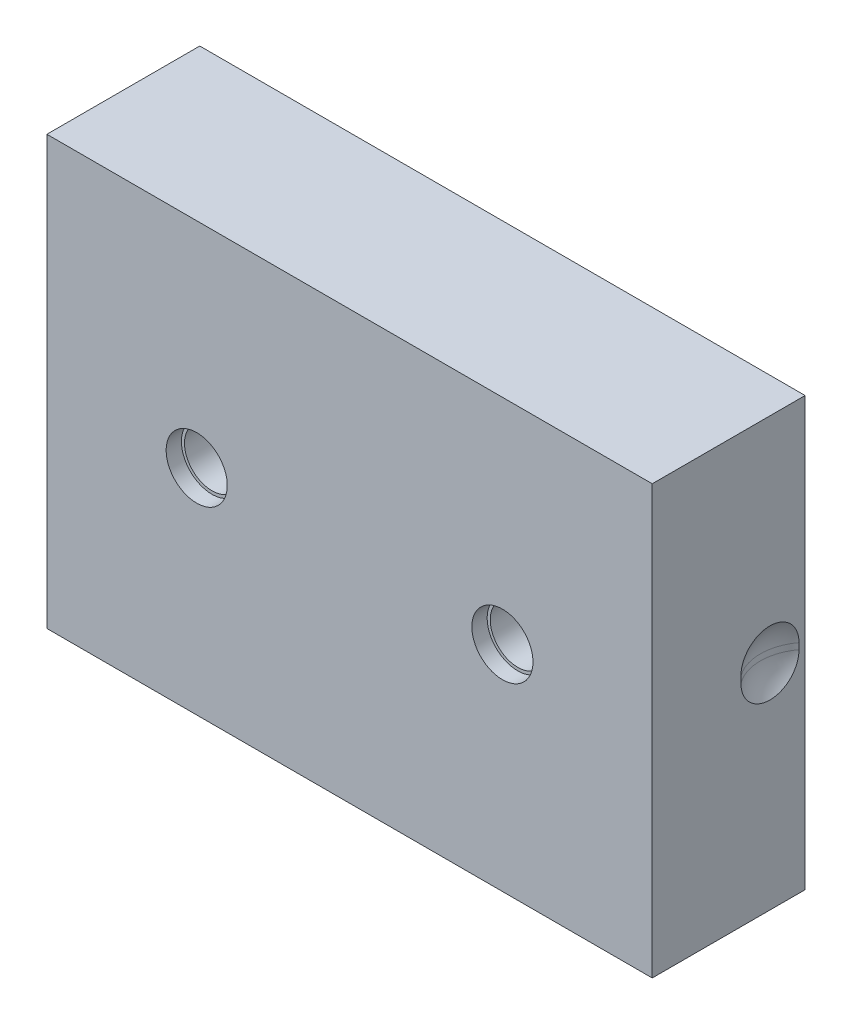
ISO-10303-21;
HEADER;
FILE_DESCRIPTION(('STEP AP214'),'2;1');
FILE_NAME('part.step','',(''),(''),'','','');
FILE_SCHEMA(('AUTOMOTIVE_DESIGN { 1 0 10303 214 1 1 1 1 }'));
ENDSEC;
DATA;
#1=APPLICATION_CONTEXT('core data for automotive mechanical design processes');
#2=APPLICATION_PROTOCOL_DEFINITION('international standard','automotive_design',2000,#1);
#3=PRODUCT_CONTEXT('',#1,'mechanical');
#4=PRODUCT('Part','Part','',(#3));
#5=PRODUCT_RELATED_PRODUCT_CATEGORY('part','',(#4));
#6=PRODUCT_DEFINITION_FORMATION('','',#4);
#7=PRODUCT_DEFINITION_CONTEXT('part definition',#1,'design');
#8=PRODUCT_DEFINITION('design','',#6,#7);
#9=PRODUCT_DEFINITION_SHAPE('','',#8);
#10=(LENGTH_UNIT() NAMED_UNIT(*) SI_UNIT(.MILLI.,.METRE.));
#11=(NAMED_UNIT(*) PLANE_ANGLE_UNIT() SI_UNIT($,.RADIAN.));
#12=(NAMED_UNIT(*) SI_UNIT($,.STERADIAN.) SOLID_ANGLE_UNIT());
#13=UNCERTAINTY_MEASURE_WITH_UNIT(LENGTH_MEASURE(1.E-05),#10,'distance_accuracy_value','');
#14=(GEOMETRIC_REPRESENTATION_CONTEXT(3) GLOBAL_UNCERTAINTY_ASSIGNED_CONTEXT((#13)) GLOBAL_UNIT_ASSIGNED_CONTEXT((#10,
#11,#12)) REPRESENTATION_CONTEXT('',''));
#15=CARTESIAN_POINT('',(0.,0.,0.));
#16=DIRECTION('',(0.,0.,1.));
#17=DIRECTION('',(1.,0.,0.));
#18=AXIS2_PLACEMENT_3D('',#15,#16,#17);
#19=CARTESIAN_POINT('',(-74.5004119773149,24.9995880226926,99.5));
#20=DIRECTION('',(0.,0.,1.));
#21=DIRECTION('',(1.,0.,0.));
#22=AXIS2_PLACEMENT_3D('',#19,#20,#21);
#23=CYLINDRICAL_SURFACE('',#22,9.);
#24=CARTESIAN_POINT('',(-74.5004119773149,24.9995880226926,79.5));
#25=DIRECTION('',(0.,0.,1.));
#26=DIRECTION('',(1.,0.,0.));
#27=AXIS2_PLACEMENT_3D('',#24,#25,#26);
#28=CIRCLE('',#27,9.);
#29=CARTESIAN_POINT('',(-65.5004119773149,24.9995880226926,79.5));
#30=VERTEX_POINT('',#29);
#31=EDGE_CURVE('E284',#30,#30,#28,.F.);
#32=ORIENTED_EDGE('',*,*,#31,.T.);
#33=EDGE_LOOP('',(#32));
#34=FACE_BOUND('',#33,.T.);
#35=CARTESIAN_POINT('',(-74.5004119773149,24.9995880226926,114.5));
#36=DIRECTION('',(0.,0.,1.));
#37=DIRECTION('',(1.,0.,0.));
#38=AXIS2_PLACEMENT_3D('',#35,#36,#37);
#39=CIRCLE('',#38,9.);
#40=CARTESIAN_POINT('',(-65.5004119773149,24.9995880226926,114.5));
#41=VERTEX_POINT('',#40);
#42=EDGE_CURVE('E282',#41,#41,#39,.T.);
#43=ORIENTED_EDGE('',*,*,#42,.T.);
#44=EDGE_LOOP('',(#43));
#45=FACE_BOUND('',#44,.T.);
#46=ADVANCED_FACE('F14',(#34,#45),#23,.F.);
#47=CARTESIAN_POINT('',(-174.500411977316,24.9995880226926,99.5));
#48=DIRECTION('',(0.,0.,1.));
#49=DIRECTION('',(1.,0.,0.));
#50=AXIS2_PLACEMENT_3D('',#47,#48,#49);
#51=CYLINDRICAL_SURFACE('',#50,9.);
#52=CARTESIAN_POINT('',(-174.500411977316,24.9995880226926,79.5));
#53=DIRECTION('',(0.,0.,1.));
#54=DIRECTION('',(1.,0.,0.));
#55=AXIS2_PLACEMENT_3D('',#52,#53,#54);
#56=CIRCLE('',#55,9.);
#57=CARTESIAN_POINT('',(-165.500411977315,24.9995880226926,79.5));
#58=VERTEX_POINT('',#57);
#59=EDGE_CURVE('E18',#58,#58,#56,.F.);
#60=ORIENTED_EDGE('',*,*,#59,.T.);
#61=EDGE_LOOP('',(#60));
#62=FACE_BOUND('',#61,.T.);
#63=CARTESIAN_POINT('',(-174.500411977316,24.9995880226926,114.5));
#64=DIRECTION('',(0.,0.,1.));
#65=DIRECTION('',(1.,0.,0.));
#66=AXIS2_PLACEMENT_3D('',#63,#64,#65);
#67=CIRCLE('',#66,9.);
#68=CARTESIAN_POINT('',(-165.500411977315,24.9995880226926,114.5));
#69=VERTEX_POINT('',#68);
#70=EDGE_CURVE('E279',#69,#69,#67,.T.);
#71=ORIENTED_EDGE('',*,*,#70,.T.);
#72=EDGE_LOOP('',(#71));
#73=FACE_BOUND('',#72,.T.);
#74=ADVANCED_FACE('F291',(#62,#73),#51,.F.);
#75=CARTESIAN_POINT('',(-174.500411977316,24.9995880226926,79.5));
#76=DIRECTION('',(0.,0.,-1.));
#77=DIRECTION('',(-1.,0.,0.));
#78=AXIS2_PLACEMENT_3D('',#75,#76,#77);
#79=PLANE('',#78);
#80=ORIENTED_EDGE('',*,*,#59,.F.);
#81=EDGE_LOOP('',(#80));
#82=FACE_BOUND('',#81,.T.);
#83=CARTESIAN_POINT('',(-174.500411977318,24.9995880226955,79.4999999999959));
#84=DIRECTION('',(0.,0.,1.));
#85=DIRECTION('',(1.,0.,0.));
#86=AXIS2_PLACEMENT_3D('',#83,#84,#85);
#87=CIRCLE('',#86,6.00000000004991);
#88=CARTESIAN_POINT('',(-168.500411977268,24.9995880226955,79.4999999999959));
#89=VERTEX_POINT('',#88);
#90=EDGE_CURVE('E276',#89,#89,#87,.F.);
#91=ORIENTED_EDGE('',*,*,#90,.T.);
#92=EDGE_LOOP('',(#91));
#93=FACE_BOUND('',#92,.T.);
#94=ADVANCED_FACE('F294',(#82,#93),#79,.F.);
#95=CARTESIAN_POINT('',(-74.5004119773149,24.9995880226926,79.5));
#96=DIRECTION('',(0.,0.,-1.));
#97=DIRECTION('',(-1.,0.,0.));
#98=AXIS2_PLACEMENT_3D('',#95,#96,#97);
#99=PLANE('',#98);
#100=ORIENTED_EDGE('',*,*,#31,.F.);
#101=EDGE_LOOP('',(#100));
#102=FACE_BOUND('',#101,.T.);
#103=CARTESIAN_POINT('',(-74.5004119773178,24.9995880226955,79.5000000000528));
#104=DIRECTION('',(0.,0.,1.));
#105=DIRECTION('',(1.,0.,0.));
#106=AXIS2_PLACEMENT_3D('',#103,#104,#105);
#107=CIRCLE('',#106,6.00000000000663);
#108=CARTESIAN_POINT('',(-68.5004119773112,24.9995880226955,79.5000000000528));
#109=VERTEX_POINT('',#108);
#110=EDGE_CURVE('E273',#109,#109,#107,.F.);
#111=ORIENTED_EDGE('',*,*,#110,.T.);
#112=EDGE_LOOP('',(#111));
#113=FACE_BOUND('',#112,.T.);
#114=ADVANCED_FACE('F297',(#102,#113),#99,.F.);
#115=CARTESIAN_POINT('',(-74.5004119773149,24.9995880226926,114.5));
#116=DIRECTION('',(0.,0.,-1.));
#117=DIRECTION('',(-1.,0.,0.));
#118=AXIS2_PLACEMENT_3D('',#115,#116,#117);
#119=PLANE('',#118);
#120=CARTESIAN_POINT('',(-74.5004119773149,24.9995880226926,114.5));
#121=DIRECTION('',(0.,0.,-1.));
#122=DIRECTION('',(-1.,0.,0.));
#123=AXIS2_PLACEMENT_3D('',#120,#121,#122);
#124=CIRCLE('',#123,10.);
#125=CARTESIAN_POINT('',(-84.5004119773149,24.9995880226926,114.5));
#126=VERTEX_POINT('',#125);
#127=EDGE_CURVE('E270',#126,#126,#124,.F.);
#128=ORIENTED_EDGE('',*,*,#127,.T.);
#129=EDGE_LOOP('',(#128));
#130=FACE_BOUND('',#129,.T.);
#131=ORIENTED_EDGE('',*,*,#42,.F.);
#132=EDGE_LOOP('',(#131));
#133=FACE_BOUND('',#132,.T.);
#134=ADVANCED_FACE('F334',(#130,#133),#119,.F.);
#135=CARTESIAN_POINT('',(-174.500411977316,24.9995880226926,114.5));
#136=DIRECTION('',(0.,0.,-1.));
#137=DIRECTION('',(-1.,0.,0.));
#138=AXIS2_PLACEMENT_3D('',#135,#136,#137);
#139=PLANE('',#138);
#140=CARTESIAN_POINT('',(-174.500411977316,24.9995880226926,114.5));
#141=DIRECTION('',(0.,0.,-1.));
#142=DIRECTION('',(-1.,0.,0.));
#143=AXIS2_PLACEMENT_3D('',#140,#141,#142);
#144=CIRCLE('',#143,10.);
#145=CARTESIAN_POINT('',(-184.500411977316,24.9995880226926,114.5));
#146=VERTEX_POINT('',#145);
#147=EDGE_CURVE('E220',#146,#146,#144,.F.);
#148=ORIENTED_EDGE('',*,*,#147,.T.);
#149=EDGE_LOOP('',(#148));
#150=FACE_BOUND('',#149,.T.);
#151=ORIENTED_EDGE('',*,*,#70,.F.);
#152=EDGE_LOOP('',(#151));
#153=FACE_BOUND('',#152,.T.);
#154=ADVANCED_FACE('F305',(#150,#153),#139,.F.);
#155=CARTESIAN_POINT('',(-174.500411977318,24.9995880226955,79.4999999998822));
#156=DIRECTION('',(0.,0.,1.));
#157=DIRECTION('',(1.,0.,0.));
#158=AXIS2_PLACEMENT_3D('',#155,#156,#157);
#159=CONICAL_SURFACE('',#158,5.99999999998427,0.523598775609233);
#160=ORIENTED_EDGE('',*,*,#90,.F.);
#161=EDGE_LOOP('',(#160));
#162=FACE_BOUND('',#161,.T.);
#163=CARTESIAN_POINT('',(-174.500411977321,24.9995880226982,78.2009618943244));
#164=DIRECTION('',(1.81804897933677E-13,-1.75169682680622E-13,-1.));
#165=DIRECTION('',(-1.,0.,-1.81804897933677E-13));
#166=AXIS2_PLACEMENT_3D('',#163,#164,#165);
#167=CIRCLE('',#166,5.25);
#168=CARTESIAN_POINT('',(-179.750411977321,24.9995880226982,78.2009618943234));
#169=VERTEX_POINT('',#168);
#170=EDGE_CURVE('E218',#169,#169,#167,.T.);
#171=ORIENTED_EDGE('',*,*,#170,.T.);
#172=EDGE_LOOP('',(#171));
#173=FACE_BOUND('',#172,.T.);
#174=ADVANCED_FACE('F301',(#162,#173),#159,.F.);
#175=CARTESIAN_POINT('',(-74.5004119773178,24.9995880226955,79.5000000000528));
#176=DIRECTION('',(0.,0.,1.));
#177=DIRECTION('',(1.,0.,0.));
#178=AXIS2_PLACEMENT_3D('',#175,#176,#177);
#179=CONICAL_SURFACE('',#178,6.00000000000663,0.523598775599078);
#180=ORIENTED_EDGE('',*,*,#110,.F.);
#181=EDGE_LOOP('',(#180));
#182=FACE_BOUND('',#181,.T.);
#183=CARTESIAN_POINT('',(-74.5004119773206,24.9995880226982,78.2009618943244));
#184=DIRECTION('',(1.81804897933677E-13,-1.75169682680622E-13,-1.));
#185=DIRECTION('',(-1.,0.,-1.81804897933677E-13));
#186=AXIS2_PLACEMENT_3D('',#183,#184,#185);
#187=CIRCLE('',#186,5.25);
#188=CARTESIAN_POINT('',(-79.7504119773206,24.9995880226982,78.2009618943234));
#189=VERTEX_POINT('',#188);
#190=EDGE_CURVE('E80',#189,#189,#187,.T.);
#191=ORIENTED_EDGE('',*,*,#190,.T.);
#192=EDGE_LOOP('',(#191));
#193=FACE_BOUND('',#192,.T.);
#194=ADVANCED_FACE('F304',(#182,#193),#179,.F.);
#195=CARTESIAN_POINT('',(-74.5004119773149,24.9995880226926,117.));
#196=DIRECTION('',(0.,0.,-1.));
#197=DIRECTION('',(-1.,0.,0.));
#198=AXIS2_PLACEMENT_3D('',#195,#196,#197);
#199=CYLINDRICAL_SURFACE('',#198,10.);
#200=CARTESIAN_POINT('',(-74.5004119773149,24.9995880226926,119.5));
#201=DIRECTION('',(0.,0.,-1.));
#202=DIRECTION('',(-1.,0.,0.));
#203=AXIS2_PLACEMENT_3D('',#200,#201,#202);
#204=CIRCLE('',#203,10.);
#205=CARTESIAN_POINT('',(-84.5004119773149,24.9995880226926,119.5));
#206=VERTEX_POINT('',#205);
#207=EDGE_CURVE('E515',#206,#206,#204,.F.);
#208=ORIENTED_EDGE('',*,*,#207,.T.);
#209=EDGE_LOOP('',(#208));
#210=FACE_BOUND('',#209,.T.);
#211=ORIENTED_EDGE('',*,*,#127,.F.);
#212=EDGE_LOOP('',(#211));
#213=FACE_BOUND('',#212,.T.);
#214=ADVANCED_FACE('F321',(#210,#213),#199,.F.);
#215=CARTESIAN_POINT('',(-174.500411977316,24.9995880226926,117.));
#216=DIRECTION('',(0.,0.,-1.));
#217=DIRECTION('',(-1.,0.,0.));
#218=AXIS2_PLACEMENT_3D('',#215,#216,#217);
#219=CYLINDRICAL_SURFACE('',#218,10.);
#220=CARTESIAN_POINT('',(-174.500411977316,24.9995880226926,119.5));
#221=DIRECTION('',(0.,0.,-1.));
#222=DIRECTION('',(-1.,0.,0.));
#223=AXIS2_PLACEMENT_3D('',#220,#221,#222);
#224=CIRCLE('',#223,10.);
#225=CARTESIAN_POINT('',(-184.500411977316,24.9995880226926,119.5));
#226=VERTEX_POINT('',#225);
#227=EDGE_CURVE('E512',#226,#226,#224,.F.);
#228=ORIENTED_EDGE('',*,*,#227,.T.);
#229=EDGE_LOOP('',(#228));
#230=FACE_BOUND('',#229,.T.);
#231=ORIENTED_EDGE('',*,*,#147,.F.);
#232=EDGE_LOOP('',(#231));
#233=FACE_BOUND('',#232,.T.);
#234=ADVANCED_FACE('F312',(#230,#233),#219,.F.);
#235=CARTESIAN_POINT('',(-174.50041197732,24.9995880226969,71.));
#236=DIRECTION('',(1.81804897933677E-13,-1.75169682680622E-13,-1.));
#237=DIRECTION('',(-1.,0.,-1.81804897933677E-13));
#238=AXIS2_PLACEMENT_3D('',#235,#236,#237);
#239=CYLINDRICAL_SURFACE('',#238,5.25);
#240=CARTESIAN_POINT('',(-174.500411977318,24.9995880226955,62.4999999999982));
#241=DIRECTION('',(1.81804897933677E-13,-1.75169682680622E-13,-1.));
#242=DIRECTION('',(-1.,0.,-1.81804897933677E-13));
#243=AXIS2_PLACEMENT_3D('',#240,#241,#242);
#244=CIRCLE('',#243,5.25);
#245=CARTESIAN_POINT('',(-179.750411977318,24.9995880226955,62.4999999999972));
#246=VERTEX_POINT('',#245);
#247=EDGE_CURVE('E517',#246,#246,#244,.F.);
#248=ORIENTED_EDGE('',*,*,#247,.F.);
#249=EDGE_LOOP('',(#248));
#250=FACE_BOUND('',#249,.T.);
#251=ORIENTED_EDGE('',*,*,#170,.F.);
#252=EDGE_LOOP('',(#251));
#253=FACE_BOUND('',#252,.T.);
#254=ADVANCED_FACE('F309',(#250,#253),#239,.F.);
#255=CARTESIAN_POINT('',(-74.5004119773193,24.9995880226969,71.));
#256=DIRECTION('',(1.81804897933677E-13,-1.75169682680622E-13,-1.));
#257=DIRECTION('',(-1.,0.,-1.81804897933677E-13));
#258=AXIS2_PLACEMENT_3D('',#255,#256,#257);
#259=CYLINDRICAL_SURFACE('',#258,5.25);
#260=CARTESIAN_POINT('',(-74.5004119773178,24.9995880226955,62.4999999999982));
#261=DIRECTION('',(1.81804897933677E-13,-1.75169682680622E-13,-1.));
#262=DIRECTION('',(-1.,0.,-1.81804897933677E-13));
#263=AXIS2_PLACEMENT_3D('',#260,#261,#262);
#264=CIRCLE('',#263,5.25);
#265=CARTESIAN_POINT('',(-79.7504119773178,24.9995880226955,62.4999999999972));
#266=VERTEX_POINT('',#265);
#267=EDGE_CURVE('E89',#266,#266,#264,.F.);
#268=ORIENTED_EDGE('',*,*,#267,.F.);
#269=EDGE_LOOP('',(#268));
#270=FACE_BOUND('',#269,.T.);
#271=ORIENTED_EDGE('',*,*,#190,.F.);
#272=EDGE_LOOP('',(#271));
#273=FACE_BOUND('',#272,.T.);
#274=ADVANCED_FACE('F311',(#270,#273),#259,.F.);
#275=CARTESIAN_POINT('',(-236.250411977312,23.9994564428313,81.));
#276=DIRECTION('',(0.548003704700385,0.746036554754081,0.378313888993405));
#277=DIRECTION('',(-0.836221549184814,0.499757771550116,0.225777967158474));
#278=AXIS2_PLACEMENT_3D('',#275,#276,#277);
#279=SPHERICAL_SURFACE('',#278,15.9);
#280=CARTESIAN_POINT('',(-236.250411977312,23.9994564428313,81.));
#281=DIRECTION('',(0.,-1.,0.));
#282=DIRECTION('',(0.,0.,-1.));
#283=AXIS2_PLACEMENT_3D('',#280,#281,#282);
#284=CIRCLE('',#283,15.9);
#285=CARTESIAN_POINT('',(-223.500411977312,23.9994564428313,90.4998684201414));
#286=VERTEX_POINT('',#285);
#287=CARTESIAN_POINT('',(-223.500411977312,23.9994564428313,71.5001315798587));
#288=VERTEX_POINT('',#287);
#289=EDGE_CURVE('E74',#286,#288,#284,.F.);
#290=ORIENTED_EDGE('',*,*,#289,.T.);
#291=CARTESIAN_POINT('',(-223.500411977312,23.9994564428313,71.5001315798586));
#292=CARTESIAN_POINT('',(-223.500411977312,23.7322696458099,71.5001028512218));
#293=CARTESIAN_POINT('',(-223.500411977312,23.4650869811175,71.5114024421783));
#294=CARTESIAN_POINT('',(-223.500411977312,22.9326331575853,71.5564507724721));
#295=CARTESIAN_POINT('',(-223.500411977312,22.6673619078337,71.5901984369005));
#296=CARTESIAN_POINT('',(-223.500411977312,22.1407933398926,71.6799039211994));
#297=CARTESIAN_POINT('',(-223.500411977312,21.8794933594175,71.7358461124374));
#298=CARTESIAN_POINT('',(-223.500411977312,21.3625354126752,71.8695336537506));
#299=CARTESIAN_POINT('',(-223.500411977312,21.1068773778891,71.9472787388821));
#300=CARTESIAN_POINT('',(-223.500411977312,20.6029003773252,72.1240632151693));
#301=CARTESIAN_POINT('',(-223.500411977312,20.3545848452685,72.2231123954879));
#302=CARTESIAN_POINT('',(-223.500411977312,19.8671762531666,72.4417813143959));
#303=CARTESIAN_POINT('',(-223.500411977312,19.6280833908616,72.5614014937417));
#304=CARTESIAN_POINT('',(-223.500411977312,19.1608739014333,72.8203339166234));
#305=CARTESIAN_POINT('',(-223.500411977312,18.9327550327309,72.9596421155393));
#306=CARTESIAN_POINT('',(-223.500411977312,18.4890635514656,73.2569781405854));
#307=CARTESIAN_POINT('',(-223.500411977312,18.2734908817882,73.4150058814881));
#308=CARTESIAN_POINT('',(-223.500411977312,17.8564156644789,73.7486640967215));
#309=CARTESIAN_POINT('',(-223.500411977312,17.6549136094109,73.9242951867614));
#310=CARTESIAN_POINT('',(-223.500411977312,17.2674244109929,74.291903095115));
#311=CARTESIAN_POINT('',(-223.500411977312,17.0814369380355,74.483879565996));
#312=CARTESIAN_POINT('',(-223.500411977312,16.7262650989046,74.8828494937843));
#313=CARTESIAN_POINT('',(-223.500411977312,16.5570834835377,75.0898453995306));
#314=CARTESIAN_POINT('',(-223.500411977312,16.2367609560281,75.5173545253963));
#315=CARTESIAN_POINT('',(-223.500411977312,16.0856200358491,75.7378677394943));
#316=CARTESIAN_POINT('',(-223.500411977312,15.8024597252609,76.190833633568));
#317=CARTESIAN_POINT('',(-223.500411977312,15.670439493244,76.423285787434));
#318=CARTESIAN_POINT('',(-223.500411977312,15.4264512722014,76.8984858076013));
#319=CARTESIAN_POINT('',(-223.500411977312,15.3144832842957,77.1412336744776));
#320=CARTESIAN_POINT('',(-223.500411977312,15.1114021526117,77.6352833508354));
#321=CARTESIAN_POINT('',(-223.500411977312,15.0202876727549,77.8865846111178));
#322=CARTESIAN_POINT('',(-223.500411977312,14.8595521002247,78.3959693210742));
#323=CARTESIAN_POINT('',(-223.500411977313,14.7899310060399,78.6540527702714));
#324=CARTESIAN_POINT('',(-223.500411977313,14.6726759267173,79.1751725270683));
#325=CARTESIAN_POINT('',(-223.500411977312,14.6250423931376,79.4382089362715));
#326=CARTESIAN_POINT('',(-223.500411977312,14.5521031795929,79.9673594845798));
#327=CARTESIAN_POINT('',(-223.500411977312,14.5267975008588,80.2334736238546));
#328=CARTESIAN_POINT('',(-223.500411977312,14.4986935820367,80.766893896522));
#329=CARTESIAN_POINT('',(-223.500411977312,14.4958958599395,81.0342000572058));
#330=CARTESIAN_POINT('',(-223.500411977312,14.5128291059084,81.5680978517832));
#331=CARTESIAN_POINT('',(-223.500411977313,14.5325600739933,81.8346894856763));
#332=CARTESIAN_POINT('',(-223.500411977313,14.5944101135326,82.3652602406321));
#333=CARTESIAN_POINT('',(-223.500411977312,14.6365289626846,82.6292393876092));
#334=CARTESIAN_POINT('',(-223.500411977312,14.7428551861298,83.152711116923));
#335=CARTESIAN_POINT('',(-223.500411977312,14.8070625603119,83.4122036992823));
#336=CARTESIAN_POINT('',(-223.500411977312,14.9571091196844,83.9248566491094));
#337=CARTESIAN_POINT('',(-223.500411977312,15.042948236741,84.178017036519));
#338=CARTESIAN_POINT('',(-223.500411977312,15.2356481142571,84.6762066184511));
#339=CARTESIAN_POINT('',(-223.500411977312,15.3425088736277,84.9212358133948));
#340=CARTESIAN_POINT('',(-223.500411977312,15.5764941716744,85.4014248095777));
#341=CARTESIAN_POINT('',(-223.500411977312,15.7036190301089,85.6365844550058));
#342=CARTESIAN_POINT('',(-223.500411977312,15.9772303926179,86.0953631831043));
#343=CARTESIAN_POINT('',(-223.500411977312,16.1237173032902,86.3189820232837));
#344=CARTESIAN_POINT('',(-223.500411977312,16.4350000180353,86.7530711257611));
#345=CARTESIAN_POINT('',(-223.500411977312,16.5997947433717,86.9635421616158));
#346=CARTESIAN_POINT('',(-223.500411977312,16.946528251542,87.3698533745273));
#347=CARTESIAN_POINT('',(-223.500411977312,17.128467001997,87.5656935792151));
#348=CARTESIAN_POINT('',(-223.500411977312,17.5081699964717,87.9413261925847));
#349=CARTESIAN_POINT('',(-223.500411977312,17.7059321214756,88.1211207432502));
#350=CARTESIAN_POINT('',(-223.500411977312,18.1158975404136,88.4634136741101));
#351=CARTESIAN_POINT('',(-223.500411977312,18.3281008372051,88.6259120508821));
#352=CARTESIAN_POINT('',(-223.500411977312,18.7655134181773,88.9325088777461));
#353=CARTESIAN_POINT('',(-223.500411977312,18.9907270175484,89.0766011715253));
#354=CARTESIAN_POINT('',(-223.500411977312,19.4524871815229,89.3452934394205));
#355=CARTESIAN_POINT('',(-223.500411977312,19.6890334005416,89.4698940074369));
#356=CARTESIAN_POINT('',(-223.500411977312,20.171936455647,89.6987950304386));
#357=CARTESIAN_POINT('',(-223.500411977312,20.4182994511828,89.8030824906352));
#358=CARTESIAN_POINT('',(-223.500411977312,20.9189357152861,89.9905132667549));
#359=CARTESIAN_POINT('',(-223.500411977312,21.1732087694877,90.0736571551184));
#360=CARTESIAN_POINT('',(-223.500411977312,21.6875235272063,90.2181196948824));
#361=CARTESIAN_POINT('',(-223.500411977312,21.9475574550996,90.2794660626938));
#362=CARTESIAN_POINT('',(-223.500411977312,22.4717641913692,90.3800228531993));
#363=CARTESIAN_POINT('',(-223.500411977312,22.735934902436,90.4192441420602));
#364=CARTESIAN_POINT('',(-223.500411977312,23.1671431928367,90.4648086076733));
#365=CARTESIAN_POINT('',(-223.500411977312,23.333490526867,90.4779644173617));
#366=CARTESIAN_POINT('',(-223.500411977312,23.6663716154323,90.4954880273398));
#367=CARTESIAN_POINT('',(-223.500411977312,23.832904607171,90.4998703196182));
#368=CARTESIAN_POINT('',(-223.500411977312,23.9994564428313,90.4998684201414));
#369=B_SPLINE_CURVE_WITH_KNOTS('',3,(#291,#292,#293,#294,#295,#296,#297,#298,#299,#300,#301,
#302,#303,#304,#305,#306,#307,#308,#309,#310,#311,#312,#313,#314,#315,#316,#317,#318,#319,#320,
#321,#322,#323,#324,#325,#326,#327,#328,#329,#330,#331,#332,#333,#334,#335,#336,#337,#338,#339,
#340,#341,#342,#343,#344,#345,#346,#347,#348,#349,#350,#351,#352,#353,#354,#355,#356,#357,#358,
#359,#360,#361,#362,#363,#364,#365,#366,#367,#368),.UNSPECIFIED.,.F.,.F.,(4,2,2,2,2,2,2,2,2,2,2,
2,2,2,2,2,2,2,2,2,2,2,2,2,2,2,2,2,2,2,2,2,2,2,2,2,2,2,4),(0.,0.801315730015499,1.60259309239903,
2.40330722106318,3.20401162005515,4.00508472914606,4.80617500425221,5.60710094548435,
6.40802324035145,7.20897355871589,8.00990685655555,8.81097103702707,9.61203486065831,
10.4130634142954,11.2140920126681,12.0150692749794,12.8160464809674,13.6170401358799,
14.418033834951,15.2190459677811,16.0200581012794,16.8210622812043,17.6220664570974,
18.4230681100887,19.2240697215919,20.0250839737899,20.8261150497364,21.6270989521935,
22.4280813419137,23.2289566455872,24.0298321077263,24.8309747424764,25.6320929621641,
26.4337220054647,27.2353293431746,28.0359137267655,28.8361045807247,29.3364921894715,
29.8360525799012),.UNSPECIFIED.);
#370=EDGE_CURVE('E72',#288,#286,#369,.T.);
#371=ORIENTED_EDGE('',*,*,#370,.T.);
#372=EDGE_LOOP('',(#290,#371));
#373=FACE_BOUND('',#372,.T.);
#374=ADVANCED_FACE('F76',(#373),#279,.F.);
#375=CARTESIAN_POINT('',(-236.250411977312,57.6643800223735,81.));
#376=DIRECTION('',(0.,-1.,0.));
#377=DIRECTION('',(0.,0.,-1.));
#378=AXIS2_PLACEMENT_3D('',#375,#376,#377);
#379=CYLINDRICAL_SURFACE('',#378,15.9);
#380=ORIENTED_EDGE('',*,*,#289,.F.);
#381=DIRECTION('',(0.,1.,0.));
#382=VECTOR('',#381,1.);
#383=CARTESIAN_POINT('',(-223.500411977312,24.9995880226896,90.4998684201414));
#384=LINE('',#383,#382);
#385=CARTESIAN_POINT('',(-223.500411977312,25.9997196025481,90.4998684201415));
#386=VERTEX_POINT('',#385);
#387=EDGE_CURVE('E92',#286,#386,#384,.T.);
#388=ORIENTED_EDGE('',*,*,#387,.T.);
#389=CARTESIAN_POINT('',(-236.250411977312,25.9997196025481,81.));
#390=DIRECTION('',(0.,-1.,0.));
#391=DIRECTION('',(0.,0.,-1.));
#392=AXIS2_PLACEMENT_3D('',#389,#390,#391);
#393=CIRCLE('',#392,15.9);
#394=CARTESIAN_POINT('',(-223.500411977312,25.9997196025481,71.5001315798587));
#395=VERTEX_POINT('',#394);
#396=EDGE_CURVE('E79',#386,#395,#393,.F.);
#397=ORIENTED_EDGE('',*,*,#396,.T.);
#398=DIRECTION('',(0.,1.,0.));
#399=VECTOR('',#398,1.);
#400=CARTESIAN_POINT('',(-223.500411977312,24.9995880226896,71.5001315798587));
#401=LINE('',#400,#399);
#402=EDGE_CURVE('E83',#395,#288,#401,.F.);
#403=ORIENTED_EDGE('',*,*,#402,.T.);
#404=EDGE_LOOP('',(#380,#388,#397,#403));
#405=FACE_BOUND('',#404,.T.);
#406=ADVANCED_FACE('F84',(#405),#379,.F.);
#407=CARTESIAN_POINT('',(-236.250411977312,25.9997196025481,81.));
#408=DIRECTION('',(0.548003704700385,0.746036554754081,0.378313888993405));
#409=DIRECTION('',(-0.836221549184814,0.499757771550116,0.225777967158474));
#410=AXIS2_PLACEMENT_3D('',#407,#408,#409);
#411=SPHERICAL_SURFACE('',#410,15.9);
#412=ORIENTED_EDGE('',*,*,#396,.F.);
#413=CARTESIAN_POINT('',(-223.500411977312,25.9997196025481,90.4998684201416));
#414=CARTESIAN_POINT('',(-223.500411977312,26.2669063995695,90.4998971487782));
#415=CARTESIAN_POINT('',(-223.500411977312,26.5340890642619,90.4885975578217));
#416=CARTESIAN_POINT('',(-223.500411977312,27.0665428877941,90.4435492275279));
#417=CARTESIAN_POINT('',(-223.500411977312,27.3318141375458,90.4098015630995));
#418=CARTESIAN_POINT('',(-223.500411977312,27.8583827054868,90.3200960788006));
#419=CARTESIAN_POINT('',(-223.500411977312,28.1196826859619,90.2641538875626));
#420=CARTESIAN_POINT('',(-223.500411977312,28.6366406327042,90.1304663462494));
#421=CARTESIAN_POINT('',(-223.500411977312,28.8922986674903,90.052721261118));
#422=CARTESIAN_POINT('',(-223.500411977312,29.3962756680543,89.8759367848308));
#423=CARTESIAN_POINT('',(-223.500411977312,29.6445912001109,89.7768876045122));
#424=CARTESIAN_POINT('',(-223.500411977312,30.1319997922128,89.5582186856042));
#425=CARTESIAN_POINT('',(-223.500411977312,30.3710926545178,89.4385985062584));
#426=CARTESIAN_POINT('',(-223.500411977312,30.8383021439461,89.1796660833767));
#427=CARTESIAN_POINT('',(-223.500411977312,31.0664210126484,89.0403578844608));
#428=CARTESIAN_POINT('',(-223.500411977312,31.5101124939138,88.7430218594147));
#429=CARTESIAN_POINT('',(-223.500411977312,31.7256851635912,88.5849941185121));
#430=CARTESIAN_POINT('',(-223.500411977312,32.1427603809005,88.2513359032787));
#431=CARTESIAN_POINT('',(-223.500411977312,32.3442624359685,88.0757048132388));
#432=CARTESIAN_POINT('',(-223.500411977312,32.7317516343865,87.7080969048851));
#433=CARTESIAN_POINT('',(-223.500411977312,32.9177391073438,87.5161204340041));
#434=CARTESIAN_POINT('',(-223.500411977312,33.2729109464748,87.1171505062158));
#435=CARTESIAN_POINT('',(-223.500411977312,33.4420925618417,86.9101546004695));
#436=CARTESIAN_POINT('',(-223.500411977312,33.7624150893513,86.4826454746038));
#437=CARTESIAN_POINT('',(-223.500411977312,33.9135560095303,86.2621322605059));
#438=CARTESIAN_POINT('',(-223.500411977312,34.1967163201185,85.8091663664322));
#439=CARTESIAN_POINT('',(-223.500411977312,34.3287365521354,85.5767142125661));
#440=CARTESIAN_POINT('',(-223.500411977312,34.5727247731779,85.1015141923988));
#441=CARTESIAN_POINT('',(-223.500411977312,34.6846927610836,84.8587663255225));
#442=CARTESIAN_POINT('',(-223.500411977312,34.8877738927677,84.3647166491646));
#443=CARTESIAN_POINT('',(-223.500411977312,34.9788883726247,84.1134153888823));
#444=CARTESIAN_POINT('',(-223.500411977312,35.1396239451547,83.6040306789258));
#445=CARTESIAN_POINT('',(-223.500411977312,35.2092450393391,83.3459472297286));
#446=CARTESIAN_POINT('',(-223.500411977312,35.3265001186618,82.8248274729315));
#447=CARTESIAN_POINT('',(-223.500411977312,35.3741336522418,82.5617910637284));
#448=CARTESIAN_POINT('',(-223.500411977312,35.4470728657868,82.0326405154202));
#449=CARTESIAN_POINT('',(-223.500411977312,35.4723785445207,81.7665263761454));
#450=CARTESIAN_POINT('',(-223.500411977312,35.5004824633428,81.233106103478));
#451=CARTESIAN_POINT('',(-223.500411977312,35.50328018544,80.9657999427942));
#452=CARTESIAN_POINT('',(-223.500411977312,35.4863469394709,80.4319021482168));
#453=CARTESIAN_POINT('',(-223.500411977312,35.4666159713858,80.1653105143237));
#454=CARTESIAN_POINT('',(-223.500411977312,35.4047659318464,79.6347397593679));
#455=CARTESIAN_POINT('',(-223.500411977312,35.3626470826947,79.3707606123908));
#456=CARTESIAN_POINT('',(-223.500411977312,35.2563208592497,78.8472888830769));
#457=CARTESIAN_POINT('',(-223.500411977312,35.1921134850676,78.5877963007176));
#458=CARTESIAN_POINT('',(-223.500411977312,35.0420669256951,78.0751433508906));
#459=CARTESIAN_POINT('',(-223.500411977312,34.9562278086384,77.8219829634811));
#460=CARTESIAN_POINT('',(-223.500411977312,34.7635279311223,77.323793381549));
#461=CARTESIAN_POINT('',(-223.500411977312,34.6566671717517,77.0787641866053));
#462=CARTESIAN_POINT('',(-223.500411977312,34.422681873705,76.5985751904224));
#463=CARTESIAN_POINT('',(-223.500411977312,34.2955570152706,76.3634155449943));
#464=CARTESIAN_POINT('',(-223.500411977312,34.0219456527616,75.9046368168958));
#465=CARTESIAN_POINT('',(-223.500411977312,33.8754587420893,75.6810179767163));
#466=CARTESIAN_POINT('',(-223.500411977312,33.5641760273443,75.246928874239));
#467=CARTESIAN_POINT('',(-223.500411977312,33.3993813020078,75.0364578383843));
#468=CARTESIAN_POINT('',(-223.500411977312,33.0526477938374,74.6301466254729));
#469=CARTESIAN_POINT('',(-223.500411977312,32.8707090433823,74.4343064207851));
#470=CARTESIAN_POINT('',(-223.500411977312,32.4910060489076,74.0586738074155));
#471=CARTESIAN_POINT('',(-223.500411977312,32.2932439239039,73.8788792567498));
#472=CARTESIAN_POINT('',(-223.500411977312,31.8832785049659,73.5365863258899));
#473=CARTESIAN_POINT('',(-223.500411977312,31.6710752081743,73.374087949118));
#474=CARTESIAN_POINT('',(-223.500411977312,31.2336626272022,73.067491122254));
#475=CARTESIAN_POINT('',(-223.500411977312,31.0084490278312,72.9233988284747));
#476=CARTESIAN_POINT('',(-223.500411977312,30.5466888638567,72.6547065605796));
#477=CARTESIAN_POINT('',(-223.500411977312,30.3101426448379,72.5301059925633));
#478=CARTESIAN_POINT('',(-223.500411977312,29.8272395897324,72.3012049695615));
#479=CARTESIAN_POINT('',(-223.500411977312,29.5808765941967,72.1969175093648));
#480=CARTESIAN_POINT('',(-223.500411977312,29.0802403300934,72.0094867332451));
#481=CARTESIAN_POINT('',(-223.500411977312,28.8259672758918,71.9263428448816));
#482=CARTESIAN_POINT('',(-223.500411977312,28.3116525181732,71.7818803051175));
#483=CARTESIAN_POINT('',(-223.500411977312,28.0516185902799,71.7205339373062));
#484=CARTESIAN_POINT('',(-223.500411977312,27.5274118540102,71.6199771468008));
#485=CARTESIAN_POINT('',(-223.500411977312,27.2632411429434,71.5807558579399));
#486=CARTESIAN_POINT('',(-223.500411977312,26.8320328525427,71.5351913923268));
#487=CARTESIAN_POINT('',(-223.500411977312,26.6656855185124,71.5220355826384));
#488=CARTESIAN_POINT('',(-223.500411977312,26.3328044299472,71.5045119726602));
#489=CARTESIAN_POINT('',(-223.500411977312,26.1662714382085,71.5001296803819));
#490=CARTESIAN_POINT('',(-223.500411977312,25.9997196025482,71.5001315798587));
#491=B_SPLINE_CURVE_WITH_KNOTS('',3,(#413,#414,#415,#416,#417,#418,#419,#420,#421,#422,#423,
#424,#425,#426,#427,#428,#429,#430,#431,#432,#433,#434,#435,#436,#437,#438,#439,#440,#441,#442,
#443,#444,#445,#446,#447,#448,#449,#450,#451,#452,#453,#454,#455,#456,#457,#458,#459,#460,#461,
#462,#463,#464,#465,#466,#467,#468,#469,#470,#471,#472,#473,#474,#475,#476,#477,#478,#479,#480,
#481,#482,#483,#484,#485,#486,#487,#488,#489,#490),.UNSPECIFIED.,.F.,.F.,(4,2,2,2,2,2,2,2,2,2,2,
2,2,2,2,2,2,2,2,2,2,2,2,2,2,2,2,2,2,2,2,2,2,2,2,2,2,2,4),(0.,0.801315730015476,1.60259309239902,
2.40330722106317,3.20401162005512,4.005084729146,4.80617500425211,5.60710094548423,
6.40802324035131,7.20897355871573,8.00990685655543,8.81097103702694,9.61203486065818,
10.4130634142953,11.214092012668,12.0150692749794,12.8160464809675,13.6170401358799,
14.418033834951,15.2190459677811,16.0200581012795,16.8210622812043,17.6220664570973,
18.4230681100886,19.2240697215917,20.0250839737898,20.8261150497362,21.6270989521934,
22.4280813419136,23.2289566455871,24.0298321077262,24.8309747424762,25.6320929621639,
26.4337220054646,27.2353293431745,28.0359137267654,28.8361045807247,29.3364921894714,
29.8360525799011),.UNSPECIFIED.);
#492=EDGE_CURVE('E94',#386,#395,#491,.T.);
#493=ORIENTED_EDGE('',*,*,#492,.T.);
#494=EDGE_LOOP('',(#412,#493));
#495=FACE_BOUND('',#494,.T.);
#496=ADVANCED_FACE('F156',(#495),#411,.F.);
#497=CARTESIAN_POINT('',(-12.7504119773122,23.9994564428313,81.));
#498=DIRECTION('',(0.548003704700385,0.746036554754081,0.378313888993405));
#499=DIRECTION('',(-0.836221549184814,0.499757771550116,0.225777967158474));
#500=AXIS2_PLACEMENT_3D('',#497,#498,#499);
#501=SPHERICAL_SURFACE('',#500,15.9);
#502=CARTESIAN_POINT('',(-12.7504119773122,23.9994564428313,81.));
#503=DIRECTION('',(0.,1.,0.));
#504=DIRECTION('',(0.,0.,1.));
#505=AXIS2_PLACEMENT_3D('',#502,#503,#504);
#506=CIRCLE('',#505,15.9);
#507=CARTESIAN_POINT('',(-25.5004119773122,23.9994564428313,71.5001315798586));
#508=VERTEX_POINT('',#507);
#509=CARTESIAN_POINT('',(-25.5004119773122,23.9994564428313,90.4998684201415));
#510=VERTEX_POINT('',#509);
#511=EDGE_CURVE('E263',#508,#510,#506,.T.);
#512=ORIENTED_EDGE('',*,*,#511,.T.);
#513=CARTESIAN_POINT('',(-25.5004119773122,23.9994564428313,90.4998684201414));
#514=CARTESIAN_POINT('',(-25.5004119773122,23.7322696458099,90.4998971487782));
#515=CARTESIAN_POINT('',(-25.5004119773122,23.4650869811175,90.4885975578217));
#516=CARTESIAN_POINT('',(-25.5004119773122,22.9326331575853,90.4435492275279));
#517=CARTESIAN_POINT('',(-25.5004119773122,22.6673619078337,90.4098015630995));
#518=CARTESIAN_POINT('',(-25.5004119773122,22.1407933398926,90.3200960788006));
#519=CARTESIAN_POINT('',(-25.5004119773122,21.8794933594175,90.2641538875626));
#520=CARTESIAN_POINT('',(-25.5004119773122,21.3625354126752,90.1304663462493));
#521=CARTESIAN_POINT('',(-25.5004119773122,21.1068773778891,90.0527212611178));
#522=CARTESIAN_POINT('',(-25.5004119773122,20.6029003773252,89.8759367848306));
#523=CARTESIAN_POINT('',(-25.5004119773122,20.3545848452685,89.7768876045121));
#524=CARTESIAN_POINT('',(-25.5004119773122,19.8671762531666,89.5582186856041));
#525=CARTESIAN_POINT('',(-25.5004119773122,19.6280833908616,89.4385985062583));
#526=CARTESIAN_POINT('',(-25.5004119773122,19.1608739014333,89.1796660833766));
#527=CARTESIAN_POINT('',(-25.5004119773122,18.9327550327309,89.0403578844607));
#528=CARTESIAN_POINT('',(-25.5004119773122,18.4890635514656,88.7430218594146));
#529=CARTESIAN_POINT('',(-25.5004119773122,18.2734908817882,88.5849941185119));
#530=CARTESIAN_POINT('',(-25.5004119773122,17.8564156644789,88.2513359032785));
#531=CARTESIAN_POINT('',(-25.5004119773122,17.6549136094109,88.0757048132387));
#532=CARTESIAN_POINT('',(-25.5004119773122,17.2674244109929,87.708096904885));
#533=CARTESIAN_POINT('',(-25.5004119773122,17.0814369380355,87.516120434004));
#534=CARTESIAN_POINT('',(-25.5004119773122,16.7262650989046,87.1171505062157));
#535=CARTESIAN_POINT('',(-25.5004119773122,16.5570834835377,86.9101546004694));
#536=CARTESIAN_POINT('',(-25.5004119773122,16.2367609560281,86.4826454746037));
#537=CARTESIAN_POINT('',(-25.5004119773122,16.0856200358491,86.2621322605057));
#538=CARTESIAN_POINT('',(-25.5004119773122,15.8024597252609,85.809166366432));
#539=CARTESIAN_POINT('',(-25.5004119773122,15.670439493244,85.576714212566));
#540=CARTESIAN_POINT('',(-25.5004119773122,15.4264512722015,85.1015141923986));
#541=CARTESIAN_POINT('',(-25.5004119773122,15.3144832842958,84.8587663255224));
#542=CARTESIAN_POINT('',(-25.5004119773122,15.1114021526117,84.3647166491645));
#543=CARTESIAN_POINT('',(-25.5004119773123,15.0202876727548,84.1134153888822));
#544=CARTESIAN_POINT('',(-25.5004119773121,14.8595521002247,83.6040306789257));
#545=CARTESIAN_POINT('',(-25.5004119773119,14.7899310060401,83.3459472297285));
#546=CARTESIAN_POINT('',(-25.5004119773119,14.6726759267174,82.8248274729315));
#547=CARTESIAN_POINT('',(-25.5004119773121,14.6250423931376,82.5617910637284));
#548=CARTESIAN_POINT('',(-25.5004119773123,14.5521031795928,82.0326405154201));
#549=CARTESIAN_POINT('',(-25.5004119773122,14.5267975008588,81.7665263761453));
#550=CARTESIAN_POINT('',(-25.5004119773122,14.4986935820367,81.2331061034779));
#551=CARTESIAN_POINT('',(-25.5004119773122,14.4958958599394,80.9657999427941));
#552=CARTESIAN_POINT('',(-25.5004119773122,14.5128291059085,80.4319021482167));
#553=CARTESIAN_POINT('',(-25.5004119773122,14.5325600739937,80.1653105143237));
#554=CARTESIAN_POINT('',(-25.5004119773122,14.594410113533,79.6347397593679));
#555=CARTESIAN_POINT('',(-25.5004119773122,14.6365289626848,79.3707606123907));
#556=CARTESIAN_POINT('',(-25.5004119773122,14.7428551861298,78.8472888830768));
#557=CARTESIAN_POINT('',(-25.5004119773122,14.8070625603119,78.5877963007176));
#558=CARTESIAN_POINT('',(-25.5004119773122,14.9571091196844,78.0751433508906));
#559=CARTESIAN_POINT('',(-25.5004119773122,15.0429482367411,77.821982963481));
#560=CARTESIAN_POINT('',(-25.5004119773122,15.2356481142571,77.3237933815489));
#561=CARTESIAN_POINT('',(-25.5004119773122,15.3425088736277,77.0787641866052));
#562=CARTESIAN_POINT('',(-25.5004119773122,15.5764941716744,76.5985751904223));
#563=CARTESIAN_POINT('',(-25.5004119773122,15.7036190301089,76.3634155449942));
#564=CARTESIAN_POINT('',(-25.5004119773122,15.977230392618,75.9046368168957));
#565=CARTESIAN_POINT('',(-25.5004119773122,16.1237173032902,75.6810179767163));
#566=CARTESIAN_POINT('',(-25.5004119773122,16.4350000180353,75.2469288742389));
#567=CARTESIAN_POINT('',(-25.5004119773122,16.5997947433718,75.0364578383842));
#568=CARTESIAN_POINT('',(-25.5004119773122,16.9465282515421,74.6301466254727));
#569=CARTESIAN_POINT('',(-25.5004119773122,17.1284670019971,74.4343064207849));
#570=CARTESIAN_POINT('',(-25.5004119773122,17.5081699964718,74.0586738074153));
#571=CARTESIAN_POINT('',(-25.5004119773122,17.7059321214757,73.8788792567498));
#572=CARTESIAN_POINT('',(-25.5004119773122,18.1158975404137,73.5365863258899));
#573=CARTESIAN_POINT('',(-25.5004119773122,18.3281008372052,73.3740879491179));
#574=CARTESIAN_POINT('',(-25.5004119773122,18.7655134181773,73.0674911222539));
#575=CARTESIAN_POINT('',(-25.5004119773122,18.9907270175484,72.9233988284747));
#576=CARTESIAN_POINT('',(-25.5004119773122,19.4524871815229,72.6547065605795));
#577=CARTESIAN_POINT('',(-25.5004119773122,19.6890334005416,72.5301059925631));
#578=CARTESIAN_POINT('',(-25.5004119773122,20.171936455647,72.3012049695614));
#579=CARTESIAN_POINT('',(-25.5004119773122,20.4182994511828,72.1969175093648));
#580=CARTESIAN_POINT('',(-25.5004119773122,20.9189357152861,72.0094867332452));
#581=CARTESIAN_POINT('',(-25.5004119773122,21.1732087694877,71.9263428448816));
#582=CARTESIAN_POINT('',(-25.5004119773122,21.6875235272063,71.7818803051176));
#583=CARTESIAN_POINT('',(-25.5004119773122,21.9475574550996,71.7205339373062));
#584=CARTESIAN_POINT('',(-25.5004119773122,22.4717641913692,71.6199771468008));
#585=CARTESIAN_POINT('',(-25.5004119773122,22.735934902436,71.5807558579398));
#586=CARTESIAN_POINT('',(-25.5004119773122,23.1671431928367,71.5351913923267));
#587=CARTESIAN_POINT('',(-25.5004119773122,23.333490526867,71.5220355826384));
#588=CARTESIAN_POINT('',(-25.5004119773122,23.6663716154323,71.5045119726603));
#589=CARTESIAN_POINT('',(-25.5004119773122,23.832904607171,71.5001296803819));
#590=CARTESIAN_POINT('',(-25.5004119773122,23.9994564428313,71.5001315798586));
#591=B_SPLINE_CURVE_WITH_KNOTS('',3,(#513,#514,#515,#516,#517,#518,#519,#520,#521,#522,#523,
#524,#525,#526,#527,#528,#529,#530,#531,#532,#533,#534,#535,#536,#537,#538,#539,#540,#541,#542,
#543,#544,#545,#546,#547,#548,#549,#550,#551,#552,#553,#554,#555,#556,#557,#558,#559,#560,#561,
#562,#563,#564,#565,#566,#567,#568,#569,#570,#571,#572,#573,#574,#575,#576,#577,#578,#579,#580,
#581,#582,#583,#584,#585,#586,#587,#588,#589,#590),.UNSPECIFIED.,.F.,.F.,(4,2,2,2,2,2,2,2,2,2,2,
2,2,2,2,2,2,2,2,2,2,2,2,2,2,2,2,2,2,2,2,2,2,2,2,2,2,2,4),(0.,0.801315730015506,1.60259309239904,
2.40330722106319,3.20401162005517,4.00508472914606,4.80617500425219,5.60710094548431,
6.40802324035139,7.20897355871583,8.0099068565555,8.81097103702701,9.61203486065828,
10.4130634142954,11.2140920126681,12.0150692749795,12.8160464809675,13.6170401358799,
14.418033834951,15.2190459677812,16.0200581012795,16.8210622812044,17.6220664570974,
18.4230681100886,19.2240697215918,20.0250839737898,20.8261150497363,21.6270989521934,
22.4280813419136,23.2289566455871,24.0298321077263,24.8309747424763,25.632092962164,
26.4337220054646,27.2353293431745,28.0359137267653,28.8361045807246,29.3364921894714,
29.8360525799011),.UNSPECIFIED.);
#592=EDGE_CURVE('E142',#510,#508,#591,.T.);
#593=ORIENTED_EDGE('',*,*,#592,.T.);
#594=EDGE_LOOP('',(#512,#593));
#595=FACE_BOUND('',#594,.T.);
#596=ADVANCED_FACE('F150',(#595),#501,.F.);
#597=CARTESIAN_POINT('',(-12.7504119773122,57.6643800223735,81.));
#598=DIRECTION('',(0.,1.,0.));
#599=DIRECTION('',(0.,0.,1.));
#600=AXIS2_PLACEMENT_3D('',#597,#598,#599);
#601=CYLINDRICAL_SURFACE('',#600,15.9);
#602=CARTESIAN_POINT('',(-12.7504119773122,25.9997196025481,81.));
#603=DIRECTION('',(0.,1.,0.));
#604=DIRECTION('',(0.,0.,1.));
#605=AXIS2_PLACEMENT_3D('',#602,#603,#604);
#606=CIRCLE('',#605,15.9);
#607=CARTESIAN_POINT('',(-25.5004119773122,25.9997196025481,71.5001315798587));
#608=VERTEX_POINT('',#607);
#609=CARTESIAN_POINT('',(-25.5004119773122,25.9997196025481,90.4998684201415));
#610=VERTEX_POINT('',#609);
#611=EDGE_CURVE('E254',#608,#610,#606,.T.);
#612=ORIENTED_EDGE('',*,*,#611,.T.);
#613=DIRECTION('',(0.,1.,0.));
#614=VECTOR('',#613,1.);
#615=CARTESIAN_POINT('',(-25.5004119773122,24.9995880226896,90.4998684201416));
#616=LINE('',#615,#614);
#617=EDGE_CURVE('E149',#610,#510,#616,.F.);
#618=ORIENTED_EDGE('',*,*,#617,.T.);
#619=ORIENTED_EDGE('',*,*,#511,.F.);
#620=DIRECTION('',(0.,1.,0.));
#621=VECTOR('',#620,1.);
#622=CARTESIAN_POINT('',(-25.5004119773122,24.9995880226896,71.5001315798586));
#623=LINE('',#622,#621);
#624=EDGE_CURVE('E148',#508,#608,#623,.T.);
#625=ORIENTED_EDGE('',*,*,#624,.T.);
#626=EDGE_LOOP('',(#612,#618,#619,#625));
#627=FACE_BOUND('',#626,.T.);
#628=ADVANCED_FACE('F155',(#627),#601,.F.);
#629=CARTESIAN_POINT('',(-12.7504119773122,25.9997196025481,81.));
#630=DIRECTION('',(0.548003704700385,0.746036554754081,0.378313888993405));
#631=DIRECTION('',(-0.836221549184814,0.499757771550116,0.225777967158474));
#632=AXIS2_PLACEMENT_3D('',#629,#630,#631);
#633=SPHERICAL_SURFACE('',#632,15.9);
#634=ORIENTED_EDGE('',*,*,#611,.F.);
#635=CARTESIAN_POINT('',(-25.5004119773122,25.9997196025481,71.5001315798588));
#636=CARTESIAN_POINT('',(-25.5004119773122,26.2669063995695,71.5001028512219));
#637=CARTESIAN_POINT('',(-25.5004119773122,26.534089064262,71.5114024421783));
#638=CARTESIAN_POINT('',(-25.5004119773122,27.0665428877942,71.5564507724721));
#639=CARTESIAN_POINT('',(-25.5004119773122,27.3318141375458,71.5901984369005));
#640=CARTESIAN_POINT('',(-25.5004119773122,27.8583827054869,71.6799039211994));
#641=CARTESIAN_POINT('',(-25.5004119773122,28.1196826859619,71.7358461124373));
#642=CARTESIAN_POINT('',(-25.5004119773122,28.6366406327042,71.8695336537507));
#643=CARTESIAN_POINT('',(-25.5004119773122,28.8922986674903,71.9472787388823));
#644=CARTESIAN_POINT('',(-25.5004119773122,29.3962756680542,72.1240632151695));
#645=CARTESIAN_POINT('',(-25.5004119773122,29.6445912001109,72.223112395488));
#646=CARTESIAN_POINT('',(-25.5004119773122,30.1319997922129,72.4417813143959));
#647=CARTESIAN_POINT('',(-25.5004119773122,30.3710926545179,72.5614014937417));
#648=CARTESIAN_POINT('',(-25.5004119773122,30.8383021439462,72.8203339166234));
#649=CARTESIAN_POINT('',(-25.5004119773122,31.0664210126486,72.9596421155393));
#650=CARTESIAN_POINT('',(-25.5004119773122,31.5101124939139,73.2569781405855));
#651=CARTESIAN_POINT('',(-25.5004119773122,31.7256851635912,73.4150058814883));
#652=CARTESIAN_POINT('',(-25.5004119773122,32.1427603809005,73.7486640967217));
#653=CARTESIAN_POINT('',(-25.5004119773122,32.3442624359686,73.9242951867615));
#654=CARTESIAN_POINT('',(-25.5004119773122,32.7317516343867,74.2919030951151));
#655=CARTESIAN_POINT('',(-25.5004119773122,32.917739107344,74.4838795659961));
#656=CARTESIAN_POINT('',(-25.5004119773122,33.2729109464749,74.8828494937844));
#657=CARTESIAN_POINT('',(-25.5004119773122,33.4420925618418,75.0898453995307));
#658=CARTESIAN_POINT('',(-25.5004119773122,33.7624150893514,75.5173545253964));
#659=CARTESIAN_POINT('',(-25.5004119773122,33.9135560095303,75.7378677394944));
#660=CARTESIAN_POINT('',(-25.5004119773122,34.1967163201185,76.1908336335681));
#661=CARTESIAN_POINT('',(-25.5004119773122,34.3287365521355,76.4232857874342));
#662=CARTESIAN_POINT('',(-25.5004119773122,34.572724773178,76.8984858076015));
#663=CARTESIAN_POINT('',(-25.5004119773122,34.6846927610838,77.1412336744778));
#664=CARTESIAN_POINT('',(-25.5004119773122,34.8877738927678,77.6352833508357));
#665=CARTESIAN_POINT('',(-25.5004119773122,34.9788883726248,77.886584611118));
#666=CARTESIAN_POINT('',(-25.5004119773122,35.1396239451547,78.3959693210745));
#667=CARTESIAN_POINT('',(-25.5004119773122,35.2092450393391,78.6540527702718));
#668=CARTESIAN_POINT('',(-25.5004119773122,35.3265001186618,79.1751725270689));
#669=CARTESIAN_POINT('',(-25.5004119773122,35.3741336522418,79.438208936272));
#670=CARTESIAN_POINT('',(-25.5004119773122,35.4470728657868,79.9673594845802));
#671=CARTESIAN_POINT('',(-25.5004119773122,35.4723785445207,80.233473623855));
#672=CARTESIAN_POINT('',(-25.5004119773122,35.5004824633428,80.7668938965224));
#673=CARTESIAN_POINT('',(-25.5004119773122,35.50328018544,81.0342000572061));
#674=CARTESIAN_POINT('',(-25.5004119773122,35.4863469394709,81.5680978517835));
#675=CARTESIAN_POINT('',(-25.5004119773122,35.4666159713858,81.8346894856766));
#676=CARTESIAN_POINT('',(-25.5004119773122,35.4047659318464,82.3652602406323));
#677=CARTESIAN_POINT('',(-25.5004119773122,35.3626470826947,82.6292393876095));
#678=CARTESIAN_POINT('',(-25.5004119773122,35.2563208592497,83.1527111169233));
#679=CARTESIAN_POINT('',(-25.5004119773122,35.1921134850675,83.4122036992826));
#680=CARTESIAN_POINT('',(-25.5004119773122,35.042066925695,83.9248566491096));
#681=CARTESIAN_POINT('',(-25.5004119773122,34.9562278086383,84.1780170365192));
#682=CARTESIAN_POINT('',(-25.5004119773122,34.7635279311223,84.6762066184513));
#683=CARTESIAN_POINT('',(-25.5004119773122,34.6566671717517,84.921235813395));
#684=CARTESIAN_POINT('',(-25.5004119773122,34.422681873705,85.4014248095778));
#685=CARTESIAN_POINT('',(-25.5004119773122,34.2955570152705,85.636584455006));
#686=CARTESIAN_POINT('',(-25.5004119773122,34.0219456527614,86.0953631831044));
#687=CARTESIAN_POINT('',(-25.5004119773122,33.8754587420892,86.3189820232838));
#688=CARTESIAN_POINT('',(-25.5004119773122,33.5641760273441,86.7530711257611));
#689=CARTESIAN_POINT('',(-25.5004119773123,33.3993813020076,86.9635421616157));
#690=CARTESIAN_POINT('',(-25.5004119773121,33.0526477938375,87.3698533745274));
#691=CARTESIAN_POINT('',(-25.5004119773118,32.8707090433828,87.5656935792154));
#692=CARTESIAN_POINT('',(-25.5004119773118,32.4910060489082,87.941326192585));
#693=CARTESIAN_POINT('',(-25.5004119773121,32.293243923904,88.1211207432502));
#694=CARTESIAN_POINT('',(-25.5004119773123,31.8832785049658,88.4634136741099));
#695=CARTESIAN_POINT('',(-25.5004119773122,31.6710752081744,88.625912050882));
#696=CARTESIAN_POINT('',(-25.5004119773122,31.2336626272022,88.932508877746));
#697=CARTESIAN_POINT('',(-25.5004119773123,31.0084490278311,89.0766011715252));
#698=CARTESIAN_POINT('',(-25.5004119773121,30.5466888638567,89.3452934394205));
#699=CARTESIAN_POINT('',(-25.500411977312,30.3101426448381,89.4698940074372));
#700=CARTESIAN_POINT('',(-25.5004119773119,29.8272395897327,89.698795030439));
#701=CARTESIAN_POINT('',(-25.5004119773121,29.5808765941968,89.8030824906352));
#702=CARTESIAN_POINT('',(-25.5004119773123,29.0802403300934,89.9905132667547));
#703=CARTESIAN_POINT('',(-25.5004119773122,28.8259672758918,90.0736571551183));
#704=CARTESIAN_POINT('',(-25.5004119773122,28.3116525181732,90.2181196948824));
#705=CARTESIAN_POINT('',(-25.5004119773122,28.0516185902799,90.2794660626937));
#706=CARTESIAN_POINT('',(-25.5004119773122,27.5274118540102,90.3800228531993));
#707=CARTESIAN_POINT('',(-25.5004119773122,27.2632411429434,90.4192441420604));
#708=CARTESIAN_POINT('',(-25.5004119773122,26.8320328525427,90.4648086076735));
#709=CARTESIAN_POINT('',(-25.5004119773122,26.6656855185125,90.4779644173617));
#710=CARTESIAN_POINT('',(-25.5004119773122,26.3328044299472,90.4954880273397));
#711=CARTESIAN_POINT('',(-25.5004119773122,26.1662714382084,90.4998703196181));
#712=CARTESIAN_POINT('',(-25.5004119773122,25.9997196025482,90.4998684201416));
#713=B_SPLINE_CURVE_WITH_KNOTS('',3,(#635,#636,#637,#638,#639,#640,#641,#642,#643,#644,#645,
#646,#647,#648,#649,#650,#651,#652,#653,#654,#655,#656,#657,#658,#659,#660,#661,#662,#663,#664,
#665,#666,#667,#668,#669,#670,#671,#672,#673,#674,#675,#676,#677,#678,#679,#680,#681,#682,#683,
#684,#685,#686,#687,#688,#689,#690,#691,#692,#693,#694,#695,#696,#697,#698,#699,#700,#701,#702,
#703,#704,#705,#706,#707,#708,#709,#710,#711,#712),.UNSPECIFIED.,.F.,.F.,(4,2,2,2,2,2,2,2,2,2,2,
2,2,2,2,2,2,2,2,2,2,2,2,2,2,2,2,2,2,2,2,2,2,2,2,2,2,2,4),(0.,0.80131573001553,1.60259309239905,
2.40330722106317,3.20401162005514,4.00508472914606,4.80617500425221,5.60710094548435,
6.40802324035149,7.20897355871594,8.00990685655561,8.81097103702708,9.61203486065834,
10.4130634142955,11.2140920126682,12.0150692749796,12.8160464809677,13.6170401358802,
14.4180338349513,15.2190459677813,16.0200581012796,16.8210622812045,17.6220664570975,
18.4230681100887,19.2240697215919,20.0250839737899,20.8261150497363,21.6270989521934,
22.4280813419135,23.228956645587,24.0298321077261,24.8309747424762,25.6320929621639,
26.4337220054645,27.2353293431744,28.0359137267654,28.8361045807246,29.3364921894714,
29.8360525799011),.UNSPECIFIED.);
#714=EDGE_CURVE('E135',#608,#610,#713,.T.);
#715=ORIENTED_EDGE('',*,*,#714,.T.);
#716=EDGE_LOOP('',(#634,#715));
#717=FACE_BOUND('',#716,.T.);
#718=ADVANCED_FACE('F166',(#717),#633,.F.);
#719=CARTESIAN_POINT('',(-124.500411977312,24.9995880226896,119.5));
#720=DIRECTION('',(0.,0.,-1.));
#721=DIRECTION('',(-1.,0.,0.));
#722=AXIS2_PLACEMENT_3D('',#719,#720,#721);
#723=PLANE('',#722);
#724=DIRECTION('',(1.,0.,0.));
#725=VECTOR('',#724,1.);
#726=CARTESIAN_POINT('',(-124.500411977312,-45.0004119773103,119.5));
#727=LINE('',#726,#725);
#728=CARTESIAN_POINT('',(-223.500411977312,-45.0004119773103,119.5));
#729=VERTEX_POINT('',#728);
#730=CARTESIAN_POINT('',(-25.5004119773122,-45.0004119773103,119.5));
#731=VERTEX_POINT('',#730);
#732=EDGE_CURVE('E227',#729,#731,#727,.T.);
#733=ORIENTED_EDGE('',*,*,#732,.T.);
#734=DIRECTION('',(0.,1.,0.));
#735=VECTOR('',#734,1.);
#736=CARTESIAN_POINT('',(-25.5004119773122,24.9995880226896,119.5));
#737=LINE('',#736,#735);
#738=CARTESIAN_POINT('',(-25.5004119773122,94.9995880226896,119.5));
#739=VERTEX_POINT('',#738);
#740=EDGE_CURVE('E239',#731,#739,#737,.T.);
#741=ORIENTED_EDGE('',*,*,#740,.T.);
#742=DIRECTION('',(1.,0.,0.));
#743=VECTOR('',#742,1.);
#744=CARTESIAN_POINT('',(-124.500411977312,94.9995880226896,119.5));
#745=LINE('',#744,#743);
#746=CARTESIAN_POINT('',(-223.500411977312,94.9995880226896,119.5));
#747=VERTEX_POINT('',#746);
#748=EDGE_CURVE('E245',#739,#747,#745,.F.);
#749=ORIENTED_EDGE('',*,*,#748,.T.);
#750=DIRECTION('',(0.,1.,0.));
#751=VECTOR('',#750,1.);
#752=CARTESIAN_POINT('',(-223.500411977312,24.9995880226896,119.5));
#753=LINE('',#752,#751);
#754=EDGE_CURVE('E165',#747,#729,#753,.F.);
#755=ORIENTED_EDGE('',*,*,#754,.T.);
#756=EDGE_LOOP('',(#733,#741,#749,#755));
#757=FACE_BOUND('',#756,.T.);
#758=ORIENTED_EDGE('',*,*,#227,.F.);
#759=EDGE_LOOP('',(#758));
#760=FACE_BOUND('',#759,.T.);
#761=ORIENTED_EDGE('',*,*,#207,.F.);
#762=EDGE_LOOP('',(#761));
#763=FACE_BOUND('',#762,.T.);
#764=ADVANCED_FACE('F170',(#757,#760,#763),#723,.F.);
#765=CARTESIAN_POINT('',(-166.045797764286,28.0849564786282,62.5));
#766=DIRECTION('',(0.,0.,-1.));
#767=DIRECTION('',(-1.,0.,0.));
#768=AXIS2_PLACEMENT_3D('',#765,#766,#767);
#769=PLANE('',#768);
#770=CARTESIAN_POINT('',(-174.500411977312,24.9995880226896,62.5));
#771=DIRECTION('',(0.,0.,-1.));
#772=DIRECTION('',(-1.,0.,0.));
#773=AXIS2_PLACEMENT_3D('',#770,#771,#772);
#774=CIRCLE('',#773,9.);
#775=CARTESIAN_POINT('',(-183.500411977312,24.9995880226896,62.5));
#776=VERTEX_POINT('',#775);
#777=EDGE_CURVE('E224',#776,#776,#774,.F.);
#778=ORIENTED_EDGE('',*,*,#777,.F.);
#779=EDGE_LOOP('',(#778));
#780=FACE_BOUND('',#779,.T.);
#781=ORIENTED_EDGE('',*,*,#247,.T.);
#782=EDGE_LOOP('',(#781));
#783=FACE_BOUND('',#782,.T.);
#784=ADVANCED_FACE('F173',(#780,#783),#769,.T.);
#785=CARTESIAN_POINT('',(-66.0457977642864,28.0849564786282,62.5));
#786=DIRECTION('',(0.,0.,-1.));
#787=DIRECTION('',(-1.,0.,0.));
#788=AXIS2_PLACEMENT_3D('',#785,#786,#787);
#789=PLANE('',#788);
#790=CARTESIAN_POINT('',(-74.5004119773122,24.9995880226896,62.5));
#791=DIRECTION('',(0.,0.,-1.));
#792=DIRECTION('',(-1.,0.,0.));
#793=AXIS2_PLACEMENT_3D('',#790,#791,#792);
#794=CIRCLE('',#793,9.);
#795=CARTESIAN_POINT('',(-83.5004119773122,24.9995880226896,62.5));
#796=VERTEX_POINT('',#795);
#797=EDGE_CURVE('E215',#796,#796,#794,.F.);
#798=ORIENTED_EDGE('',*,*,#797,.F.);
#799=EDGE_LOOP('',(#798));
#800=FACE_BOUND('',#799,.T.);
#801=ORIENTED_EDGE('',*,*,#267,.T.);
#802=EDGE_LOOP('',(#801));
#803=FACE_BOUND('',#802,.T.);
#804=ADVANCED_FACE('F120',(#800,#803),#789,.T.);
#805=CARTESIAN_POINT('',(-223.500411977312,24.9995880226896,94.5));
#806=DIRECTION('',(1.,0.,0.));
#807=DIRECTION('',(0.,0.,-1.));
#808=AXIS2_PLACEMENT_3D('',#805,#806,#807);
#809=PLANE('',#808);
#810=ORIENTED_EDGE('',*,*,#754,.F.);
#811=DIRECTION('',(0.,0.,-1.));
#812=VECTOR('',#811,1.);
#813=CARTESIAN_POINT('',(-223.500411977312,94.9995880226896,94.5));
#814=LINE('',#813,#812);
#815=CARTESIAN_POINT('',(-223.500411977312,94.9995880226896,69.5));
#816=VERTEX_POINT('',#815);
#817=EDGE_CURVE('E258',#747,#816,#814,.T.);
#818=ORIENTED_EDGE('',*,*,#817,.T.);
#819=DIRECTION('',(0.,1.,0.));
#820=VECTOR('',#819,1.);
#821=CARTESIAN_POINT('',(-223.500411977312,24.9995880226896,69.5));
#822=LINE('',#821,#820);
#823=CARTESIAN_POINT('',(-223.500411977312,-45.0004119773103,69.5));
#824=VERTEX_POINT('',#823);
#825=EDGE_CURVE('E210',#824,#816,#822,.T.);
#826=ORIENTED_EDGE('',*,*,#825,.F.);
#827=DIRECTION('',(0.,0.,1.));
#828=VECTOR('',#827,1.);
#829=CARTESIAN_POINT('',(-223.500411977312,-45.0004119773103,94.5));
#830=LINE('',#829,#828);
#831=EDGE_CURVE('E230',#824,#729,#830,.T.);
#832=ORIENTED_EDGE('',*,*,#831,.T.);
#833=EDGE_LOOP('',(#810,#818,#826,#832));
#834=FACE_BOUND('',#833,.T.);
#835=ORIENTED_EDGE('',*,*,#387,.F.);
#836=ORIENTED_EDGE('',*,*,#370,.F.);
#837=ORIENTED_EDGE('',*,*,#402,.F.);
#838=ORIENTED_EDGE('',*,*,#492,.F.);
#839=EDGE_LOOP('',(#835,#836,#837,#838));
#840=FACE_BOUND('',#839,.T.);
#841=ADVANCED_FACE('F91',(#834,#840),#809,.F.);
#842=CARTESIAN_POINT('',(-124.500411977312,94.9995880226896,94.5));
#843=DIRECTION('',(0.,-1.,0.));
#844=DIRECTION('',(0.,0.,-1.));
#845=AXIS2_PLACEMENT_3D('',#842,#843,#844);
#846=PLANE('',#845);
#847=ORIENTED_EDGE('',*,*,#748,.F.);
#848=DIRECTION('',(0.,0.,1.));
#849=VECTOR('',#848,1.);
#850=CARTESIAN_POINT('',(-25.5004119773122,94.9995880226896,94.5));
#851=LINE('',#850,#849);
#852=CARTESIAN_POINT('',(-25.5004119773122,94.9995880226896,69.5));
#853=VERTEX_POINT('',#852);
#854=EDGE_CURVE('E235',#739,#853,#851,.F.);
#855=ORIENTED_EDGE('',*,*,#854,.T.);
#856=DIRECTION('',(-1.,0.,0.));
#857=VECTOR('',#856,1.);
#858=CARTESIAN_POINT('',(-124.500411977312,94.9995880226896,69.5));
#859=LINE('',#858,#857);
#860=EDGE_CURVE('E206',#816,#853,#859,.F.);
#861=ORIENTED_EDGE('',*,*,#860,.F.);
#862=ORIENTED_EDGE('',*,*,#817,.F.);
#863=EDGE_LOOP('',(#847,#855,#861,#862));
#864=FACE_BOUND('',#863,.T.);
#865=ADVANCED_FACE('F119',(#864),#846,.F.);
#866=CARTESIAN_POINT('',(-25.5004119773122,24.9995880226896,94.5));
#867=DIRECTION('',(-1.,0.,0.));
#868=DIRECTION('',(0.,0.,1.));
#869=AXIS2_PLACEMENT_3D('',#866,#867,#868);
#870=PLANE('',#869);
#871=ORIENTED_EDGE('',*,*,#740,.F.);
#872=DIRECTION('',(0.,0.,1.));
#873=VECTOR('',#872,1.);
#874=CARTESIAN_POINT('',(-25.5004119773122,-45.0004119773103,94.5));
#875=LINE('',#874,#873);
#876=CARTESIAN_POINT('',(-25.5004119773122,-45.0004119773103,69.5));
#877=VERTEX_POINT('',#876);
#878=EDGE_CURVE('E33',#731,#877,#875,.F.);
#879=ORIENTED_EDGE('',*,*,#878,.T.);
#880=DIRECTION('',(0.,1.,0.));
#881=VECTOR('',#880,1.);
#882=CARTESIAN_POINT('',(-25.5004119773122,24.9995880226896,69.5));
#883=LINE('',#882,#881);
#884=EDGE_CURVE('E202',#853,#877,#883,.F.);
#885=ORIENTED_EDGE('',*,*,#884,.F.);
#886=ORIENTED_EDGE('',*,*,#854,.F.);
#887=EDGE_LOOP('',(#871,#879,#885,#886));
#888=FACE_BOUND('',#887,.T.);
#889=ORIENTED_EDGE('',*,*,#624,.F.);
#890=ORIENTED_EDGE('',*,*,#592,.F.);
#891=ORIENTED_EDGE('',*,*,#617,.F.);
#892=ORIENTED_EDGE('',*,*,#714,.F.);
#893=EDGE_LOOP('',(#889,#890,#891,#892));
#894=FACE_BOUND('',#893,.T.);
#895=ADVANCED_FACE('F126',(#888,#894),#870,.F.);
#896=CARTESIAN_POINT('',(-124.500411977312,-45.0004119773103,94.5));
#897=DIRECTION('',(0.,1.,0.));
#898=DIRECTION('',(0.,0.,1.));
#899=AXIS2_PLACEMENT_3D('',#896,#897,#898);
#900=PLANE('',#899);
#901=ORIENTED_EDGE('',*,*,#732,.F.);
#902=ORIENTED_EDGE('',*,*,#831,.F.);
#903=DIRECTION('',(-1.,0.,0.));
#904=VECTOR('',#903,1.);
#905=CARTESIAN_POINT('',(-124.500411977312,-45.0004119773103,69.5));
#906=LINE('',#905,#904);
#907=EDGE_CURVE('E204',#877,#824,#906,.T.);
#908=ORIENTED_EDGE('',*,*,#907,.F.);
#909=ORIENTED_EDGE('',*,*,#878,.F.);
#910=EDGE_LOOP('',(#901,#902,#908,#909));
#911=FACE_BOUND('',#910,.T.);
#912=ADVANCED_FACE('F131',(#911),#900,.F.);
#913=CARTESIAN_POINT('',(-174.500411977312,24.9995880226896,69.5));
#914=DIRECTION('',(0.,0.,-1.));
#915=DIRECTION('',(-1.,0.,0.));
#916=AXIS2_PLACEMENT_3D('',#913,#914,#915);
#917=CYLINDRICAL_SURFACE('',#916,9.);
#918=ORIENTED_EDGE('',*,*,#777,.T.);
#919=EDGE_LOOP('',(#918));
#920=FACE_BOUND('',#919,.T.);
#921=CARTESIAN_POINT('',(-174.500411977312,24.9995880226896,69.4999999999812));
#922=DIRECTION('',(0.,0.,-1.));
#923=DIRECTION('',(-1.,0.,0.));
#924=AXIS2_PLACEMENT_3D('',#921,#922,#923);
#925=CIRCLE('',#924,9.);
#926=CARTESIAN_POINT('',(-183.500411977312,24.9995880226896,69.4999999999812));
#927=VERTEX_POINT('',#926);
#928=EDGE_CURVE('E24',#927,#927,#925,.F.);
#929=ORIENTED_EDGE('',*,*,#928,.F.);
#930=EDGE_LOOP('',(#929));
#931=FACE_BOUND('',#930,.T.);
#932=ADVANCED_FACE('F192',(#920,#931),#917,.T.);
#933=CARTESIAN_POINT('',(-74.5004119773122,24.9995880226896,69.5));
#934=DIRECTION('',(0.,0.,-1.));
#935=DIRECTION('',(-1.,0.,0.));
#936=AXIS2_PLACEMENT_3D('',#933,#934,#935);
#937=CYLINDRICAL_SURFACE('',#936,9.);
#938=ORIENTED_EDGE('',*,*,#797,.T.);
#939=EDGE_LOOP('',(#938));
#940=FACE_BOUND('',#939,.T.);
#941=CARTESIAN_POINT('',(-74.5004119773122,24.9995880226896,69.5));
#942=DIRECTION('',(0.,0.,-1.));
#943=DIRECTION('',(-1.,0.,0.));
#944=AXIS2_PLACEMENT_3D('',#941,#942,#943);
#945=CIRCLE('',#944,9.);
#946=CARTESIAN_POINT('',(-83.5004119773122,24.9995880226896,69.5));
#947=VERTEX_POINT('',#946);
#948=EDGE_CURVE('E9',#947,#947,#945,.F.);
#949=ORIENTED_EDGE('',*,*,#948,.F.);
#950=EDGE_LOOP('',(#949));
#951=FACE_BOUND('',#950,.T.);
#952=ADVANCED_FACE('F186',(#940,#951),#937,.T.);
#953=CARTESIAN_POINT('',(-124.500411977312,24.9995880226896,69.5));
#954=DIRECTION('',(0.,0.,-1.));
#955=DIRECTION('',(-1.,0.,0.));
#956=AXIS2_PLACEMENT_3D('',#953,#954,#955);
#957=PLANE('',#956);
#958=ORIENTED_EDGE('',*,*,#948,.T.);
#959=EDGE_LOOP('',(#958));
#960=FACE_BOUND('',#959,.T.);
#961=ORIENTED_EDGE('',*,*,#928,.T.);
#962=EDGE_LOOP('',(#961));
#963=FACE_BOUND('',#962,.T.);
#964=ORIENTED_EDGE('',*,*,#884,.T.);
#965=ORIENTED_EDGE('',*,*,#907,.T.);
#966=ORIENTED_EDGE('',*,*,#825,.T.);
#967=ORIENTED_EDGE('',*,*,#860,.T.);
#968=EDGE_LOOP('',(#964,#965,#966,#967));
#969=FACE_BOUND('',#968,.T.);
#970=ADVANCED_FACE('F16',(#960,#963,#969),#957,.T.);
#971=CLOSED_SHELL('',(#46,#74,#94,#114,#134,#154,#174,#194,#214,#234,#254,#274,#374,#406,#496,
#596,#628,#718,#764,#784,#804,#841,#865,#895,#912,#932,#952,#970));
#972=MANIFOLD_SOLID_BREP('B1',#971);
#973=ADVANCED_BREP_SHAPE_REPRESENTATION('',(#18,#972),#14);
#974=SHAPE_DEFINITION_REPRESENTATION(#9,#973);
ENDSEC;
END-ISO-10303-21;
